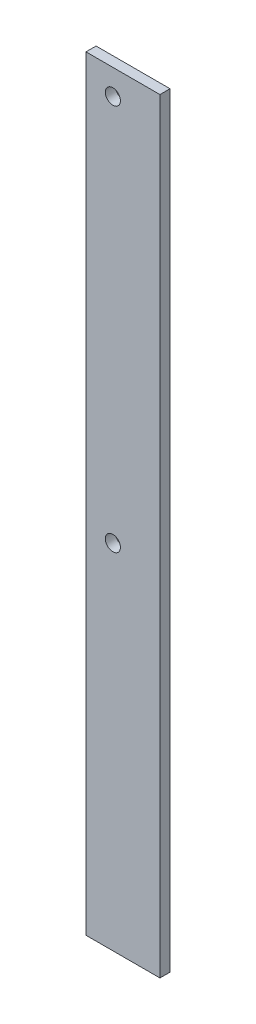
ISO-10303-21;
HEADER;
FILE_DESCRIPTION(('STEP AP214'),'2;1');
FILE_NAME('part.step','',(''),(''),'','','');
FILE_SCHEMA(('AUTOMOTIVE_DESIGN { 1 0 10303 214 1 1 1 1 }'));
ENDSEC;
DATA;
#1=APPLICATION_CONTEXT('core data for automotive mechanical design processes');
#2=APPLICATION_PROTOCOL_DEFINITION('international standard','automotive_design',2000,#1);
#3=PRODUCT_CONTEXT('',#1,'mechanical');
#4=PRODUCT('Part','Part','',(#3));
#5=PRODUCT_RELATED_PRODUCT_CATEGORY('part','',(#4));
#6=PRODUCT_DEFINITION_FORMATION('','',#4);
#7=PRODUCT_DEFINITION_CONTEXT('part definition',#1,'design');
#8=PRODUCT_DEFINITION('design','',#6,#7);
#9=PRODUCT_DEFINITION_SHAPE('','',#8);
#10=(LENGTH_UNIT() NAMED_UNIT(*) SI_UNIT(.MILLI.,.METRE.));
#11=(NAMED_UNIT(*) PLANE_ANGLE_UNIT() SI_UNIT($,.RADIAN.));
#12=(NAMED_UNIT(*) SI_UNIT($,.STERADIAN.) SOLID_ANGLE_UNIT());
#13=UNCERTAINTY_MEASURE_WITH_UNIT(LENGTH_MEASURE(1.E-05),#10,'distance_accuracy_value','');
#14=(GEOMETRIC_REPRESENTATION_CONTEXT(3) GLOBAL_UNCERTAINTY_ASSIGNED_CONTEXT((#13)) GLOBAL_UNIT_ASSIGNED_CONTEXT((#10,
#11,#12)) REPRESENTATION_CONTEXT('',''));
#15=CARTESIAN_POINT('',(0.,0.,0.));
#16=DIRECTION('',(0.,0.,1.));
#17=DIRECTION('',(1.,0.,0.));
#18=AXIS2_PLACEMENT_3D('',#15,#16,#17);
#19=CARTESIAN_POINT('',(0.,0.,6.));
#20=DIRECTION('',(0.,0.,1.));
#21=DIRECTION('',(1.,0.,0.));
#22=AXIS2_PLACEMENT_3D('',#19,#20,#21);
#23=PLANE('',#22);
#24=CARTESIAN_POINT('',(-6.,212.5,6.));
#25=DIRECTION('',(0.,0.,1.));
#26=DIRECTION('',(1.,0.,0.));
#27=AXIS2_PLACEMENT_3D('',#24,#25,#26);
#28=CIRCLE('',#27,4.5);
#29=CARTESIAN_POINT('',(-1.5,212.5,6.));
#30=VERTEX_POINT('',#29);
#31=EDGE_CURVE('E25',#30,#30,#28,.T.);
#32=ORIENTED_EDGE('',*,*,#31,.F.);
#33=EDGE_LOOP('',(#32));
#34=FACE_BOUND('',#33,.T.);
#35=CARTESIAN_POINT('',(-6.,-17.5,6.));
#36=DIRECTION('',(0.,0.,1.));
#37=DIRECTION('',(1.,0.,0.));
#38=AXIS2_PLACEMENT_3D('',#35,#36,#37);
#39=CIRCLE('',#38,4.5);
#40=CARTESIAN_POINT('',(-1.5,-17.5,6.));
#41=VERTEX_POINT('',#40);
#42=EDGE_CURVE('E86',#41,#41,#39,.T.);
#43=ORIENTED_EDGE('',*,*,#42,.F.);
#44=EDGE_LOOP('',(#43));
#45=FACE_BOUND('',#44,.T.);
#46=DIRECTION('',(1.,0.,0.));
#47=VECTOR('',#46,1.);
#48=CARTESIAN_POINT('',(-22.,-227.5,6.));
#49=LINE('',#48,#47);
#50=CARTESIAN_POINT('',(-22.,-227.5,6.));
#51=VERTEX_POINT('',#50);
#52=CARTESIAN_POINT('',(22.,-227.5,6.));
#53=VERTEX_POINT('',#52);
#54=EDGE_CURVE('E132',#51,#53,#49,.T.);
#55=ORIENTED_EDGE('',*,*,#54,.T.);
#56=DIRECTION('',(0.,1.,0.));
#57=VECTOR('',#56,1.);
#58=CARTESIAN_POINT('',(22.,-227.5,6.));
#59=LINE('',#58,#57);
#60=CARTESIAN_POINT('',(22.,227.5,6.));
#61=VERTEX_POINT('',#60);
#62=EDGE_CURVE('E142',#53,#61,#59,.T.);
#63=ORIENTED_EDGE('',*,*,#62,.T.);
#64=DIRECTION('',(-1.,0.,0.));
#65=VECTOR('',#64,1.);
#66=CARTESIAN_POINT('',(22.,227.5,6.));
#67=LINE('',#66,#65);
#68=CARTESIAN_POINT('',(-22.,227.5,6.));
#69=VERTEX_POINT('',#68);
#70=EDGE_CURVE('E112',#61,#69,#67,.T.);
#71=ORIENTED_EDGE('',*,*,#70,.T.);
#72=DIRECTION('',(0.,-1.,0.));
#73=VECTOR('',#72,1.);
#74=CARTESIAN_POINT('',(-22.,227.5,6.));
#75=LINE('',#74,#73);
#76=EDGE_CURVE('E98',#69,#51,#75,.T.);
#77=ORIENTED_EDGE('',*,*,#76,.T.);
#78=EDGE_LOOP('',(#55,#63,#71,#77));
#79=FACE_BOUND('',#78,.T.);
#80=ADVANCED_FACE('F16',(#34,#45,#79),#23,.T.);
#81=CARTESIAN_POINT('',(0.,0.,0.));
#82=DIRECTION('',(0.,0.,1.));
#83=DIRECTION('',(1.,0.,0.));
#84=AXIS2_PLACEMENT_3D('',#81,#82,#83);
#85=PLANE('',#84);
#86=CARTESIAN_POINT('',(-6.,212.5,0.));
#87=DIRECTION('',(0.,0.,1.));
#88=DIRECTION('',(1.,0.,0.));
#89=AXIS2_PLACEMENT_3D('',#86,#87,#88);
#90=CIRCLE('',#89,4.5);
#91=CARTESIAN_POINT('',(-1.5,212.5,0.));
#92=VERTEX_POINT('',#91);
#93=EDGE_CURVE('E10',#92,#92,#90,.T.);
#94=ORIENTED_EDGE('',*,*,#93,.T.);
#95=EDGE_LOOP('',(#94));
#96=FACE_BOUND('',#95,.T.);
#97=CARTESIAN_POINT('',(-6.,-17.5,0.));
#98=DIRECTION('',(0.,0.,1.));
#99=DIRECTION('',(1.,0.,0.));
#100=AXIS2_PLACEMENT_3D('',#97,#98,#99);
#101=CIRCLE('',#100,4.5);
#102=CARTESIAN_POINT('',(-1.5,-17.5,0.));
#103=VERTEX_POINT('',#102);
#104=EDGE_CURVE('E78',#103,#103,#101,.T.);
#105=ORIENTED_EDGE('',*,*,#104,.T.);
#106=EDGE_LOOP('',(#105));
#107=FACE_BOUND('',#106,.T.);
#108=DIRECTION('',(0.,-1.,0.));
#109=VECTOR('',#108,1.);
#110=CARTESIAN_POINT('',(-22.,227.5,0.));
#111=LINE('',#110,#109);
#112=CARTESIAN_POINT('',(-22.,227.5,0.));
#113=VERTEX_POINT('',#112);
#114=CARTESIAN_POINT('',(-22.,-227.5,0.));
#115=VERTEX_POINT('',#114);
#116=EDGE_CURVE('E111',#113,#115,#111,.T.);
#117=ORIENTED_EDGE('',*,*,#116,.F.);
#118=DIRECTION('',(-1.,0.,0.));
#119=VECTOR('',#118,1.);
#120=CARTESIAN_POINT('',(22.,227.5,0.));
#121=LINE('',#120,#119);
#122=CARTESIAN_POINT('',(22.,227.5,0.));
#123=VERTEX_POINT('',#122);
#124=EDGE_CURVE('E129',#123,#113,#121,.T.);
#125=ORIENTED_EDGE('',*,*,#124,.F.);
#126=DIRECTION('',(0.,1.,0.));
#127=VECTOR('',#126,1.);
#128=CARTESIAN_POINT('',(22.,-227.5,0.));
#129=LINE('',#128,#127);
#130=CARTESIAN_POINT('',(22.,-227.5,0.));
#131=VERTEX_POINT('',#130);
#132=EDGE_CURVE('E134',#131,#123,#129,.T.);
#133=ORIENTED_EDGE('',*,*,#132,.F.);
#134=DIRECTION('',(1.,0.,0.));
#135=VECTOR('',#134,1.);
#136=CARTESIAN_POINT('',(-22.,-227.5,0.));
#137=LINE('',#136,#135);
#138=EDGE_CURVE('E154',#115,#131,#137,.T.);
#139=ORIENTED_EDGE('',*,*,#138,.F.);
#140=EDGE_LOOP('',(#117,#125,#133,#139));
#141=FACE_BOUND('',#140,.T.);
#142=ADVANCED_FACE('F168',(#96,#107,#141),#85,.F.);
#143=CARTESIAN_POINT('',(-6.,212.5,0.));
#144=DIRECTION('',(0.,0.,-1.));
#145=DIRECTION('',(1.,0.,0.));
#146=AXIS2_PLACEMENT_3D('',#143,#144,#145);
#147=CYLINDRICAL_SURFACE('',#146,4.5);
#148=DIRECTION('',(0.,0.,1.));
#149=VECTOR('',#148,1.);
#150=CARTESIAN_POINT('',(-1.5,212.5,0.));
#151=LINE('',#150,#149);
#152=EDGE_CURVE('E96',#92,#30,#151,.T.);
#153=ORIENTED_EDGE('',*,*,#152,.T.);
#154=ORIENTED_EDGE('',*,*,#31,.T.);
#155=ORIENTED_EDGE('',*,*,#152,.F.);
#156=ORIENTED_EDGE('',*,*,#93,.F.);
#157=EDGE_LOOP('',(#153,#154,#155,#156));
#158=FACE_BOUND('',#157,.T.);
#159=ADVANCED_FACE('F180',(#158),#147,.F.);
#160=CARTESIAN_POINT('',(-6.,-17.5,0.));
#161=DIRECTION('',(0.,0.,-1.));
#162=DIRECTION('',(1.,0.,0.));
#163=AXIS2_PLACEMENT_3D('',#160,#161,#162);
#164=CYLINDRICAL_SURFACE('',#163,4.5);
#165=DIRECTION('',(0.,0.,1.));
#166=VECTOR('',#165,1.);
#167=CARTESIAN_POINT('',(-1.5,-17.5,0.));
#168=LINE('',#167,#166);
#169=EDGE_CURVE('E88',#103,#41,#168,.T.);
#170=ORIENTED_EDGE('',*,*,#169,.T.);
#171=ORIENTED_EDGE('',*,*,#42,.T.);
#172=ORIENTED_EDGE('',*,*,#169,.F.);
#173=ORIENTED_EDGE('',*,*,#104,.F.);
#174=EDGE_LOOP('',(#170,#171,#172,#173));
#175=FACE_BOUND('',#174,.T.);
#176=ADVANCED_FACE('F87',(#175),#164,.F.);
#177=CARTESIAN_POINT('',(-22.,227.5,0.));
#178=DIRECTION('',(1.,0.,0.));
#179=DIRECTION('',(0.,1.,0.));
#180=AXIS2_PLACEMENT_3D('',#177,#178,#179);
#181=PLANE('',#180);
#182=ORIENTED_EDGE('',*,*,#116,.T.);
#183=DIRECTION('',(0.,0.,1.));
#184=VECTOR('',#183,1.);
#185=CARTESIAN_POINT('',(-22.,-227.5,0.));
#186=LINE('',#185,#184);
#187=EDGE_CURVE('E133',#115,#51,#186,.T.);
#188=ORIENTED_EDGE('',*,*,#187,.T.);
#189=ORIENTED_EDGE('',*,*,#76,.F.);
#190=DIRECTION('',(0.,0.,1.));
#191=VECTOR('',#190,1.);
#192=CARTESIAN_POINT('',(-22.,227.5,0.));
#193=LINE('',#192,#191);
#194=EDGE_CURVE('E109',#113,#69,#193,.T.);
#195=ORIENTED_EDGE('',*,*,#194,.F.);
#196=EDGE_LOOP('',(#182,#188,#189,#195));
#197=FACE_BOUND('',#196,.T.);
#198=ADVANCED_FACE('F172',(#197),#181,.F.);
#199=CARTESIAN_POINT('',(22.,227.5,0.));
#200=DIRECTION('',(0.,-1.,0.));
#201=DIRECTION('',(0.,0.,-1.));
#202=AXIS2_PLACEMENT_3D('',#199,#200,#201);
#203=PLANE('',#202);
#204=ORIENTED_EDGE('',*,*,#124,.T.);
#205=ORIENTED_EDGE('',*,*,#194,.T.);
#206=ORIENTED_EDGE('',*,*,#70,.F.);
#207=DIRECTION('',(0.,0.,1.));
#208=VECTOR('',#207,1.);
#209=CARTESIAN_POINT('',(22.,227.5,0.));
#210=LINE('',#209,#208);
#211=EDGE_CURVE('E139',#123,#61,#210,.T.);
#212=ORIENTED_EDGE('',*,*,#211,.F.);
#213=EDGE_LOOP('',(#204,#205,#206,#212));
#214=FACE_BOUND('',#213,.T.);
#215=ADVANCED_FACE('F171',(#214),#203,.F.);
#216=CARTESIAN_POINT('',(22.,-227.5,0.));
#217=DIRECTION('',(-1.,0.,0.));
#218=DIRECTION('',(0.,0.,1.));
#219=AXIS2_PLACEMENT_3D('',#216,#217,#218);
#220=PLANE('',#219);
#221=ORIENTED_EDGE('',*,*,#132,.T.);
#222=ORIENTED_EDGE('',*,*,#211,.T.);
#223=ORIENTED_EDGE('',*,*,#62,.F.);
#224=DIRECTION('',(0.,0.,1.));
#225=VECTOR('',#224,1.);
#226=CARTESIAN_POINT('',(22.,-227.5,0.));
#227=LINE('',#226,#225);
#228=EDGE_CURVE('E157',#131,#53,#227,.T.);
#229=ORIENTED_EDGE('',*,*,#228,.F.);
#230=EDGE_LOOP('',(#221,#222,#223,#229));
#231=FACE_BOUND('',#230,.T.);
#232=ADVANCED_FACE('F170',(#231),#220,.F.);
#233=CARTESIAN_POINT('',(-22.,-227.5,0.));
#234=DIRECTION('',(0.,1.,0.));
#235=DIRECTION('',(1.,0.,0.));
#236=AXIS2_PLACEMENT_3D('',#233,#234,#235);
#237=PLANE('',#236);
#238=ORIENTED_EDGE('',*,*,#138,.T.);
#239=ORIENTED_EDGE('',*,*,#228,.T.);
#240=ORIENTED_EDGE('',*,*,#54,.F.);
#241=ORIENTED_EDGE('',*,*,#187,.F.);
#242=EDGE_LOOP('',(#238,#239,#240,#241));
#243=FACE_BOUND('',#242,.T.);
#244=ADVANCED_FACE('F165',(#243),#237,.F.);
#245=CLOSED_SHELL('',(#80,#142,#159,#176,#198,#215,#232,#244));
#246=MANIFOLD_SOLID_BREP('B1',#245);
#247=ADVANCED_BREP_SHAPE_REPRESENTATION('',(#18,#246),#14);
#248=SHAPE_DEFINITION_REPRESENTATION(#9,#247);
ENDSEC;
END-ISO-10303-21;
